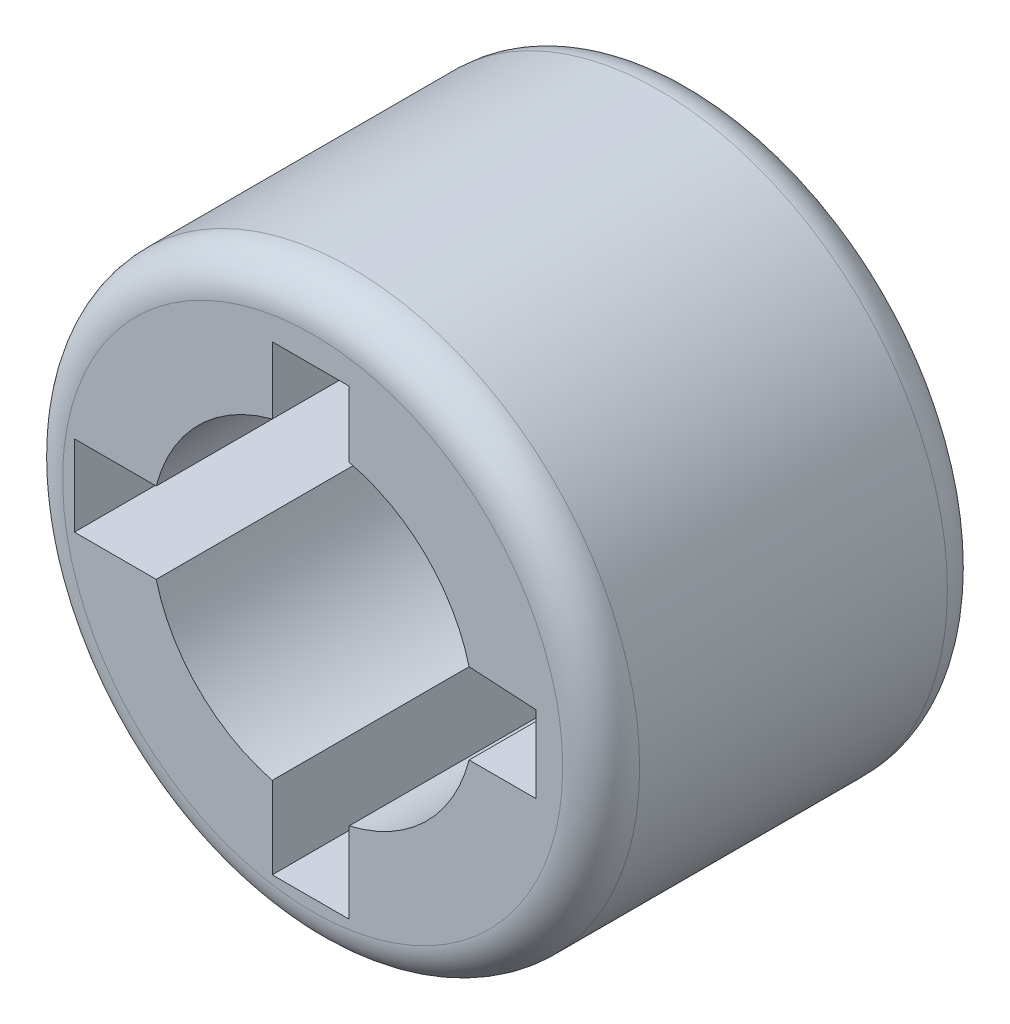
from build123d import *

# Parameters (mm, degrees)
SKETCH1_R           = 7.5
BOSS_EXTRUDE1_DEPTH = 10
FILLET1_R           = 1


with BuildPart() as part:
    # Sketch1 → Boss-Extrude1 (new body)
    with BuildSketch(Plane.XY):
        Circle(SKETCH1_R)
        with BuildLine():
            Line((-6.193232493, -1.05), (-4.066632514, -1.05))
            ThreePointArc((-4.066632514, -1.05), (-2.969848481, -2.969848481), (-1.05, -4.066632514))
            Line((-1.05, -4.066632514), (-1.05, -6.193649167))
            Line((-1.05, -6.193649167), (0.95, -6.193649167))
            Line((0.95, -6.193649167), (0.95, -4.091148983))
            ThreePointArc((0.95, -4.091148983), (2.93322301, -3.00602774), (4.066632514, -1.05))
            Line((4.066632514, -1.05), (5.806350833, -1.05))
            Line((5.806350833, -1.05), (5.806350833, 0.95))
            Line((5.806350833, 0.95), (4.066632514, 1.05))
            ThreePointArc((4.066632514, 1.05), (2.93322301, 3.00602774), (0.95, 4.091148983))
            Line((0.95, 4.091148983), (0.95, 5.806350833))
            Line((0.95, 5.806350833), (-1.05, 5.806350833))
            Line((-1.05, 5.806350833), (-1.05, 4.066632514))
            ThreePointArc((-1.05, 4.066632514), (-2.969848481, 2.969848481), (-4.066632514, 1.05))
            Line((-4.066632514, 1.05), (-6.193232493, 1.05))
            Line((-6.193232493, 1.05), (-6.193232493, -1.05))
        make_face(mode=Mode.SUBTRACT)
    extrude(amount=BOSS_EXTRUDE1_DEPTH)

    # Fillet1
    fillet1_edges = [part.edges().sort_by_distance(p)[0] for p in [
        (-7.5, 0, 0),
        (-7.5, 0, 10),
    ]]
    fillet(fillet1_edges, radius=FILLET1_R)


solid = part.part
